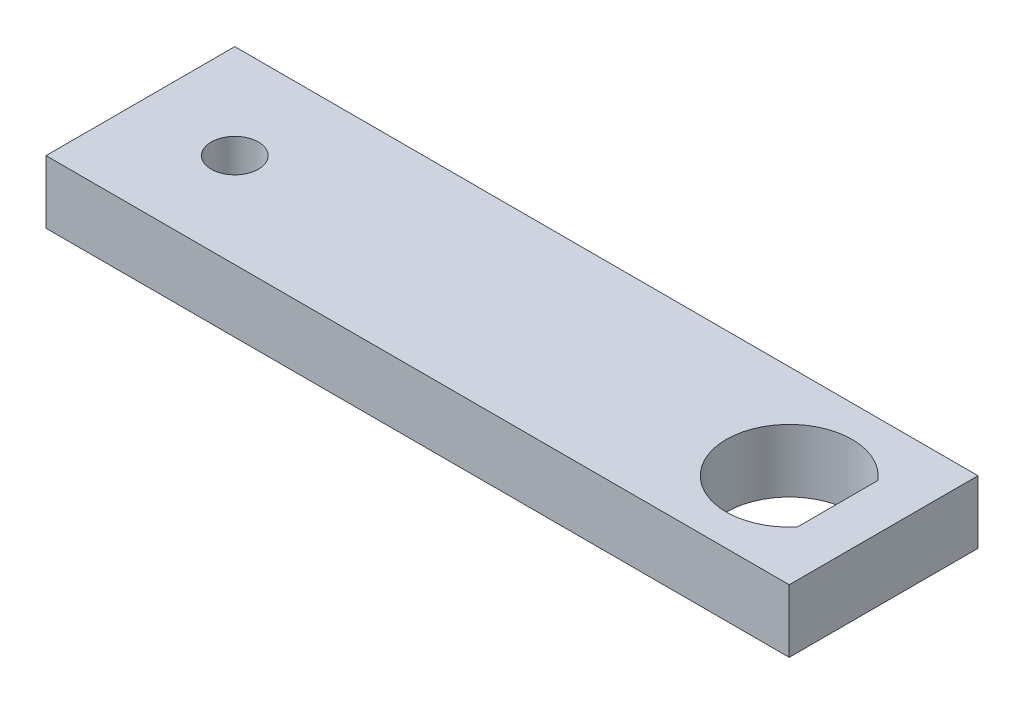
from build123d import *

# Parameters (mm, degrees)
SKETCH1_W          = 75
SKETCH1_H          = 6.35
BASE_EXTRUDE_DEPTH = 19.05
CUT_EXTRUDE1_DEPTH = 78.641644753
SKETCH3_R          = 2.38125
CUT_EXTRUDE2_DEPTH = 78.641644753


with BuildPart() as part:
    # Sketch1 → Base-Extrude (new body)
    with BuildSketch(Plane.XY):
        with Locations((37.5, 3.175)):
            Rectangle(SKETCH1_W, SKETCH1_H)
    extrude(amount=BASE_EXTRUDE_DEPTH)

    # Sketch2 → Cut-Extrude1 (cut, through all)
    with BuildSketch(Plane(origin=(0, 6.35, 0), x_dir=(-1, 0, 0), z_dir=(0, 1, 0))):
        with BuildLine():
            Line((-70.3645, 5.473421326), (-70.3645, 13.576578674))
            ThreePointArc((-70.3645, 13.576578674), (-59.125, 9.525), (-70.3645, 5.473421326))
        make_face()
    extrude(amount=-CUT_EXTRUDE1_DEPTH, mode=Mode.SUBTRACT)

    # Sketch3 → Cut-Extrude2 (cut, through all)
    with BuildSketch(Plane(origin=(0, 6.35, 0), x_dir=(-1, 0, 0), z_dir=(0, 1, 0))):
        with Locations((-9.525, 9.525)):
            Circle(SKETCH3_R)
    extrude(amount=-CUT_EXTRUDE2_DEPTH, mode=Mode.SUBTRACT)


solid = part.part
